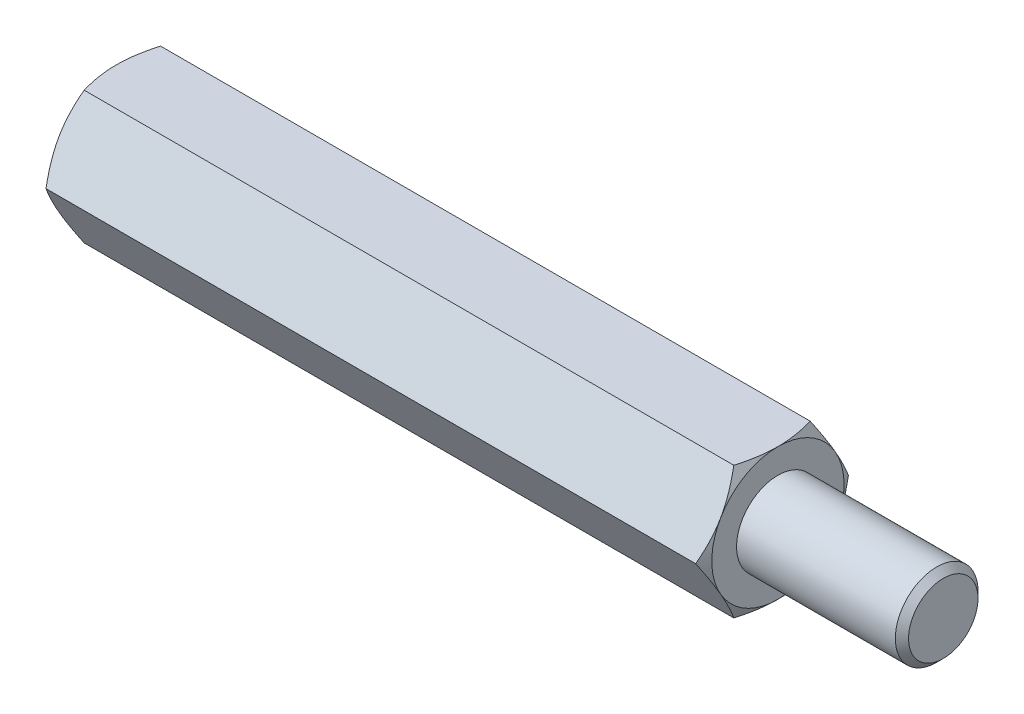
from build123d import *

# Parameters (mm, degrees)
EXTRUDE2_DEPTH = 20
SKETCH3_R      = 2.1
EXTRUDE3_DEPTH = 10
SKETCH5_R      = 2.5
EXTRUDE4_DEPTH = 10
CHAMFER1_SIZE  = 0.4


with BuildPart() as part:
    # Sketch1 → Extrude2 (new, symmetric)
    with BuildSketch(Plane(origin=(0, 0, 0), x_dir=(0, 0, -1), z_dir=(1, 0, 0))):
        Polygon((2.309401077, 4), (-2.309401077, 4), (-4.618802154, 0), (-2.309401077, -4), (2.309401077, -4), (4.618802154, 0), align=None)
    extrude(amount=EXTRUDE2_DEPTH, both=True)

    # Sketch2 → Cut-Revolve1 (revolve, cut)
    with BuildSketch(Plane.XY):
        with BuildLine():
            Line((-20, 4), (-18.5, 6.598076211))
            ThreePointArc((-18.5, 6.598076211), (-18.98810136, 7.776457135), (-20, 7))
            Line((-20, 7), (-20, 4))
        make_face()
    cut_revolve1 = revolve(axis=Axis((0, 0, 0), (1, 0, 0)), mode=Mode.SUBTRACT)

    # Mirror1: Cut-Revolve1 across plane
    add(cut_revolve1.mirror(Plane(origin=(0, 0, 0), x_dir=(0, 0, 1), z_dir=(1, 0, 0))), mode=Mode.SUBTRACT)

    # Sketch3 → Extrude3 (cut)
    with BuildSketch(Plane.ZY.offset(20)):
        Circle(SKETCH3_R)
    extrude(amount=-EXTRUDE3_DEPTH, mode=Mode.SUBTRACT)

    # Sketch4 → Cut-Revolve2 (revolve, cut)
    with BuildSketch(Plane.XY, mode=Mode.PRIVATE) as cut_revolve2_sk:
        Polygon((-10, 0), (-10, 2.1), (-8.787564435, 0), align=None)
    revolve(cut_revolve2_sk.sketch.rotate(Axis((-8.787564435, 0, 0), (-1, 0, 0)), 270), axis=Axis((-8.787564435, 0, 0), (-1, 0, 0)), mode=Mode.SUBTRACT)

    # Sketch5 → Extrude4 (add)
    with BuildSketch(Plane(origin=(20, 0, 0), x_dir=(0, 0, -1), z_dir=(1, 0, 0))):
        Circle(SKETCH5_R)
    extrude(amount=EXTRUDE4_DEPTH)

    # Chamfer1
    chamfer1_edges = [part.edges().sort_by_distance(p)[0] for p in [
        (30, 0, 2.5),
    ]]
    chamfer(chamfer1_edges, length=CHAMFER1_SIZE)


solid = part.part
